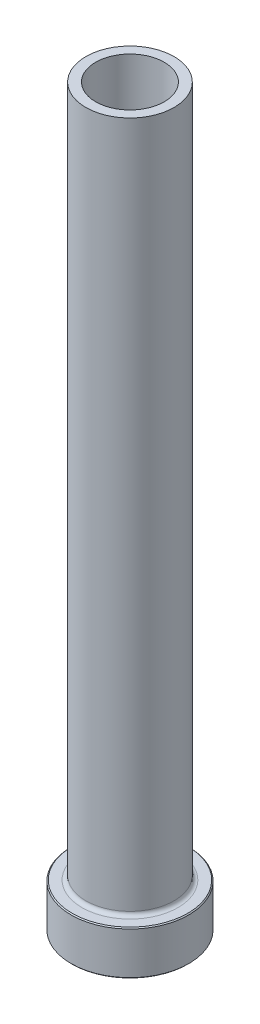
ISO-10303-21;
HEADER;
FILE_DESCRIPTION(('STEP AP214'),'2;1');
FILE_NAME('part.step','',(''),(''),'','','');
FILE_SCHEMA(('AUTOMOTIVE_DESIGN { 1 0 10303 214 1 1 1 1 }'));
ENDSEC;
DATA;
#1=APPLICATION_CONTEXT('core data for automotive mechanical design processes');
#2=APPLICATION_PROTOCOL_DEFINITION('international standard','automotive_design',2000,#1);
#3=PRODUCT_CONTEXT('',#1,'mechanical');
#4=PRODUCT('Part','Part','',(#3));
#5=PRODUCT_RELATED_PRODUCT_CATEGORY('part','',(#4));
#6=PRODUCT_DEFINITION_FORMATION('','',#4);
#7=PRODUCT_DEFINITION_CONTEXT('part definition',#1,'design');
#8=PRODUCT_DEFINITION('design','',#6,#7);
#9=PRODUCT_DEFINITION_SHAPE('','',#8);
#10=(LENGTH_UNIT() NAMED_UNIT(*) SI_UNIT(.MILLI.,.METRE.));
#11=(NAMED_UNIT(*) PLANE_ANGLE_UNIT() SI_UNIT($,.RADIAN.));
#12=(NAMED_UNIT(*) SI_UNIT($,.STERADIAN.) SOLID_ANGLE_UNIT());
#13=UNCERTAINTY_MEASURE_WITH_UNIT(LENGTH_MEASURE(1.E-05),#10,'distance_accuracy_value','');
#14=(GEOMETRIC_REPRESENTATION_CONTEXT(3) GLOBAL_UNCERTAINTY_ASSIGNED_CONTEXT((#13)) GLOBAL_UNIT_ASSIGNED_CONTEXT((#10,
#11,#12)) REPRESENTATION_CONTEXT('',''));
#15=CARTESIAN_POINT('',(0.,0.,0.));
#16=DIRECTION('',(0.,0.,1.));
#17=DIRECTION('',(1.,0.,0.));
#18=AXIS2_PLACEMENT_3D('',#15,#16,#17);
#19=CARTESIAN_POINT('',(0.,92.1876809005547,0.));
#20=DIRECTION('',(0.,1.,0.));
#21=DIRECTION('',(0.,0.,1.));
#22=AXIS2_PLACEMENT_3D('',#19,#20,#21);
#23=CYLINDRICAL_SURFACE('',#22,7.);
#24=CARTESIAN_POINT('',(0.,150.,0.));
#25=DIRECTION('',(0.,1.,0.));
#26=DIRECTION('',(0.,0.,1.));
#27=AXIS2_PLACEMENT_3D('',#24,#25,#26);
#28=CIRCLE('',#27,7.);
#29=CARTESIAN_POINT('',(0.,150.,7.));
#30=VERTEX_POINT('',#29);
#31=EDGE_CURVE('E62',#30,#30,#28,.T.);
#32=ORIENTED_EDGE('',*,*,#31,.T.);
#33=EDGE_LOOP('',(#32));
#34=FACE_BOUND('',#33,.T.);
#35=CARTESIAN_POINT('',(0.,95.,0.));
#36=DIRECTION('',(0.,1.,0.));
#37=DIRECTION('',(0.,0.,1.));
#38=AXIS2_PLACEMENT_3D('',#35,#36,#37);
#39=CIRCLE('',#38,7.);
#40=CARTESIAN_POINT('',(0.,95.,7.));
#41=VERTEX_POINT('',#40);
#42=EDGE_CURVE('E71',#41,#41,#39,.T.);
#43=ORIENTED_EDGE('',*,*,#42,.F.);
#44=EDGE_LOOP('',(#43));
#45=FACE_BOUND('',#44,.T.);
#46=ADVANCED_FACE('F30',(#34,#45),#23,.F.);
#47=CARTESIAN_POINT('',(-7.,150.,0.));
#48=DIRECTION('',(0.,1.,0.));
#49=DIRECTION('',(0.,0.,1.));
#50=AXIS2_PLACEMENT_3D('',#47,#48,#49);
#51=PLANE('',#50);
#52=CARTESIAN_POINT('',(0.,150.,0.));
#53=DIRECTION('',(0.,1.,0.));
#54=DIRECTION('',(0.,0.,1.));
#55=AXIS2_PLACEMENT_3D('',#52,#53,#54);
#56=CIRCLE('',#55,9.00000000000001);
#57=CARTESIAN_POINT('',(0.,150.,9.00000000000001));
#58=VERTEX_POINT('',#57);
#59=EDGE_CURVE('E65',#58,#58,#56,.T.);
#60=ORIENTED_EDGE('',*,*,#59,.T.);
#61=EDGE_LOOP('',(#60));
#62=FACE_BOUND('',#61,.T.);
#63=ORIENTED_EDGE('',*,*,#31,.F.);
#64=EDGE_LOOP('',(#63));
#65=FACE_BOUND('',#64,.T.);
#66=ADVANCED_FACE('F79',(#62,#65),#51,.T.);
#67=CARTESIAN_POINT('',(0.,92.1876809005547,0.));
#68=DIRECTION('',(0.,1.,0.));
#69=DIRECTION('',(0.,0.,1.));
#70=AXIS2_PLACEMENT_3D('',#67,#68,#69);
#71=CYLINDRICAL_SURFACE('',#70,9.);
#72=CARTESIAN_POINT('',(0.,9.8,0.));
#73=DIRECTION('',(0.,1.,0.));
#74=DIRECTION('',(0.,0.,1.));
#75=AXIS2_PLACEMENT_3D('',#72,#73,#74);
#76=CIRCLE('',#75,9.);
#77=CARTESIAN_POINT('',(0.,9.8,9.));
#78=VERTEX_POINT('',#77);
#79=EDGE_CURVE('E59',#78,#78,#76,.T.);
#80=ORIENTED_EDGE('',*,*,#79,.T.);
#81=EDGE_LOOP('',(#80));
#82=FACE_BOUND('',#81,.T.);
#83=ORIENTED_EDGE('',*,*,#59,.F.);
#84=EDGE_LOOP('',(#83));
#85=FACE_BOUND('',#84,.T.);
#86=ADVANCED_FACE('F85',(#82,#85),#71,.T.);
#87=CARTESIAN_POINT('',(-8.99999999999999,9.,0.));
#88=DIRECTION('',(0.,1.,0.));
#89=DIRECTION('',(0.,0.,1.));
#90=AXIS2_PLACEMENT_3D('',#87,#88,#89);
#91=PLANE('',#90);
#92=CARTESIAN_POINT('',(0.,9.,0.));
#93=DIRECTION('',(0.,1.,0.));
#94=DIRECTION('',(0.,0.,1.));
#95=AXIS2_PLACEMENT_3D('',#92,#93,#94);
#96=CIRCLE('',#95,11.8);
#97=CARTESIAN_POINT('',(0.,9.,11.8));
#98=VERTEX_POINT('',#97);
#99=EDGE_CURVE('E53',#98,#98,#96,.T.);
#100=ORIENTED_EDGE('',*,*,#99,.T.);
#101=EDGE_LOOP('',(#100));
#102=FACE_BOUND('',#101,.T.);
#103=CARTESIAN_POINT('',(0.,9.,0.));
#104=DIRECTION('',(0.,1.,0.));
#105=DIRECTION('',(0.,0.,1.));
#106=AXIS2_PLACEMENT_3D('',#103,#104,#105);
#107=CIRCLE('',#106,9.8);
#108=CARTESIAN_POINT('',(0.,9.,9.8));
#109=VERTEX_POINT('',#108);
#110=EDGE_CURVE('E56',#109,#109,#107,.F.);
#111=ORIENTED_EDGE('',*,*,#110,.T.);
#112=EDGE_LOOP('',(#111));
#113=FACE_BOUND('',#112,.T.);
#114=ADVANCED_FACE('F111',(#102,#113),#91,.T.);
#115=CARTESIAN_POINT('',(0.,92.1876809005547,0.));
#116=DIRECTION('',(0.,1.,0.));
#117=DIRECTION('',(0.,0.,1.));
#118=AXIS2_PLACEMENT_3D('',#115,#116,#117);
#119=CYLINDRICAL_SURFACE('',#118,12.);
#120=CARTESIAN_POINT('',(0.,8.8,0.));
#121=DIRECTION('',(0.,1.,0.));
#122=DIRECTION('',(0.,0.,1.));
#123=AXIS2_PLACEMENT_3D('',#120,#121,#122);
#124=CIRCLE('',#123,12.);
#125=CARTESIAN_POINT('',(0.,8.8,12.));
#126=VERTEX_POINT('',#125);
#127=EDGE_CURVE('E45',#126,#126,#124,.F.);
#128=ORIENTED_EDGE('',*,*,#127,.T.);
#129=EDGE_LOOP('',(#128));
#130=FACE_BOUND('',#129,.T.);
#131=CARTESIAN_POINT('',(0.,0.199999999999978,0.));
#132=DIRECTION('',(0.,-1.,0.));
#133=DIRECTION('',(0.,0.,-1.));
#134=AXIS2_PLACEMENT_3D('',#131,#132,#133);
#135=CIRCLE('',#134,12.);
#136=CARTESIAN_POINT('',(0.,0.199999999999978,12.));
#137=VERTEX_POINT('',#136);
#138=EDGE_CURVE('E50',#137,#137,#135,.F.);
#139=ORIENTED_EDGE('',*,*,#138,.T.);
#140=EDGE_LOOP('',(#139));
#141=FACE_BOUND('',#140,.T.);
#142=ADVANCED_FACE('F108',(#130,#141),#119,.T.);
#143=CARTESIAN_POINT('',(-12.,0.,0.));
#144=DIRECTION('',(0.,-1.,0.));
#145=DIRECTION('',(0.,0.,-1.));
#146=AXIS2_PLACEMENT_3D('',#143,#144,#145);
#147=PLANE('',#146);
#148=CARTESIAN_POINT('',(0.,0.,0.));
#149=DIRECTION('',(0.,-1.,0.));
#150=DIRECTION('',(0.,0.,-1.));
#151=AXIS2_PLACEMENT_3D('',#148,#149,#150);
#152=CIRCLE('',#151,7.74999999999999);
#153=CARTESIAN_POINT('',(0.,0.,-7.74999999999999));
#154=VERTEX_POINT('',#153);
#155=EDGE_CURVE('E37',#154,#154,#152,.F.);
#156=ORIENTED_EDGE('',*,*,#155,.T.);
#157=EDGE_LOOP('',(#156));
#158=FACE_BOUND('',#157,.T.);
#159=CARTESIAN_POINT('',(0.,0.,0.));
#160=DIRECTION('',(0.,-1.,0.));
#161=DIRECTION('',(0.,0.,-1.));
#162=AXIS2_PLACEMENT_3D('',#159,#160,#161);
#163=CIRCLE('',#162,11.8);
#164=CARTESIAN_POINT('',(0.,0.,11.8));
#165=VERTEX_POINT('',#164);
#166=EDGE_CURVE('E41',#165,#165,#163,.T.);
#167=ORIENTED_EDGE('',*,*,#166,.T.);
#168=EDGE_LOOP('',(#167));
#169=FACE_BOUND('',#168,.T.);
#170=ADVANCED_FACE('F110',(#158,#169),#147,.T.);
#171=CARTESIAN_POINT('',(0.,92.1876809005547,0.));
#172=DIRECTION('',(0.,1.,0.));
#173=DIRECTION('',(0.,0.,1.));
#174=AXIS2_PLACEMENT_3D('',#171,#172,#173);
#175=CYLINDRICAL_SURFACE('',#174,7.25);
#176=CARTESIAN_POINT('',(0.,0.5,0.));
#177=DIRECTION('',(0.,-1.,0.));
#178=DIRECTION('',(0.,0.,-1.));
#179=AXIS2_PLACEMENT_3D('',#176,#177,#178);
#180=CIRCLE('',#179,7.25);
#181=CARTESIAN_POINT('',(0.,0.5,-7.25));
#182=VERTEX_POINT('',#181);
#183=EDGE_CURVE('E10',#182,#182,#180,.T.);
#184=ORIENTED_EDGE('',*,*,#183,.T.);
#185=EDGE_LOOP('',(#184));
#186=FACE_BOUND('',#185,.T.);
#187=CARTESIAN_POINT('',(0.,83.,0.));
#188=DIRECTION('',(0.,1.,0.));
#189=DIRECTION('',(0.,0.,1.));
#190=AXIS2_PLACEMENT_3D('',#187,#188,#189);
#191=CIRCLE('',#190,7.25);
#192=CARTESIAN_POINT('',(0.,83.,7.25));
#193=VERTEX_POINT('',#192);
#194=EDGE_CURVE('E68',#193,#193,#191,.T.);
#195=ORIENTED_EDGE('',*,*,#194,.T.);
#196=EDGE_LOOP('',(#195));
#197=FACE_BOUND('',#196,.T.);
#198=ADVANCED_FACE('F118',(#186,#197),#175,.F.);
#199=CARTESIAN_POINT('',(0.,83.,0.));
#200=DIRECTION('',(0.,-1.,0.));
#201=DIRECTION('',(0.,0.,-1.));
#202=AXIS2_PLACEMENT_3D('',#199,#200,#201);
#203=CONICAL_SURFACE('',#202,7.25,0.0208303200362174);
#204=ORIENTED_EDGE('',*,*,#42,.T.);
#205=EDGE_LOOP('',(#204));
#206=FACE_BOUND('',#205,.T.);
#207=ORIENTED_EDGE('',*,*,#194,.F.);
#208=EDGE_LOOP('',(#207));
#209=FACE_BOUND('',#208,.T.);
#210=ADVANCED_FACE('F75',(#206,#209),#203,.F.);
#211=CARTESIAN_POINT('',(0.,9.8,0.));
#212=DIRECTION('',(0.,1.,0.));
#213=DIRECTION('',(0.,0.,1.));
#214=AXIS2_PLACEMENT_3D('',#211,#212,#213);
#215=TOROIDAL_SURFACE('',#214,9.8,0.8);
#216=ORIENTED_EDGE('',*,*,#110,.F.);
#217=EDGE_LOOP('',(#216));
#218=FACE_BOUND('',#217,.T.);
#219=ORIENTED_EDGE('',*,*,#79,.F.);
#220=EDGE_LOOP('',(#219));
#221=FACE_BOUND('',#220,.T.);
#222=ADVANCED_FACE('F90',(#218,#221),#215,.F.);
#223=CARTESIAN_POINT('',(0.,9.00000000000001,0.));
#224=DIRECTION('',(0.,-1.,0.));
#225=DIRECTION('',(0.,0.,-1.));
#226=AXIS2_PLACEMENT_3D('',#223,#224,#225);
#227=CONICAL_SURFACE('',#226,11.8,0.785398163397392);
#228=ORIENTED_EDGE('',*,*,#127,.F.);
#229=EDGE_LOOP('',(#228));
#230=FACE_BOUND('',#229,.T.);
#231=ORIENTED_EDGE('',*,*,#99,.F.);
#232=EDGE_LOOP('',(#231));
#233=FACE_BOUND('',#232,.T.);
#234=ADVANCED_FACE('F93',(#230,#233),#227,.T.);
#235=CARTESIAN_POINT('',(0.,0.199999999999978,0.));
#236=DIRECTION('',(0.,1.,0.));
#237=DIRECTION('',(0.,0.,1.));
#238=AXIS2_PLACEMENT_3D('',#235,#236,#237);
#239=CONICAL_SURFACE('',#238,12.,0.785398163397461);
#240=CARTESIAN_POINT('',(0.,0.,11.8));
#241=CARTESIAN_POINT('',(0.,0.00208333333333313,11.8020833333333));
#242=CARTESIAN_POINT('',(0.,0.00416666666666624,11.8041666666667));
#243=CARTESIAN_POINT('',(0.,0.00833333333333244,11.8083333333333));
#244=CARTESIAN_POINT('',(0.,0.0104166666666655,11.8104166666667));
#245=CARTESIAN_POINT('',(0.,0.0145833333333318,11.8145833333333));
#246=CARTESIAN_POINT('',(0.,0.0166666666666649,11.8166666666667));
#247=CARTESIAN_POINT('',(0.,0.0208333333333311,11.8208333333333));
#248=CARTESIAN_POINT('',(0.,0.0229166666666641,11.8229166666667));
#249=CARTESIAN_POINT('',(0.,0.0270833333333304,11.8270833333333));
#250=CARTESIAN_POINT('',(0.,0.0291666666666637,11.8291666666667));
#251=CARTESIAN_POINT('',(0.,0.0333333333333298,11.8333333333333));
#252=CARTESIAN_POINT('',(0.,0.0354166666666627,11.8354166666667));
#253=CARTESIAN_POINT('',(0.,0.0395833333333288,11.8395833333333));
#254=CARTESIAN_POINT('',(0.,0.0416666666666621,11.8416666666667));
#255=CARTESIAN_POINT('',(0.,0.0458333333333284,11.8458333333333));
#256=CARTESIAN_POINT('',(0.,0.0479166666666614,11.8479166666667));
#257=CARTESIAN_POINT('',(0.,0.0520833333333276,11.8520833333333));
#258=CARTESIAN_POINT('',(0.,0.0541666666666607,11.8541666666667));
#259=CARTESIAN_POINT('',(0.,0.0583333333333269,11.8583333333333));
#260=CARTESIAN_POINT('',(0.,0.06041666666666,11.8604166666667));
#261=CARTESIAN_POINT('',(0.,0.0645833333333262,11.8645833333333));
#262=CARTESIAN_POINT('',(0.,0.0666666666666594,11.8666666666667));
#263=CARTESIAN_POINT('',(0.,0.0708333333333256,11.8708333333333));
#264=CARTESIAN_POINT('',(0.,0.0729166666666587,11.8729166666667));
#265=CARTESIAN_POINT('',(0.,0.0770833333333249,11.8770833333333));
#266=CARTESIAN_POINT('',(0.,0.079166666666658,11.8791666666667));
#267=CARTESIAN_POINT('',(0.,0.0833333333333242,11.8833333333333));
#268=CARTESIAN_POINT('',(0.,0.0854166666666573,11.8854166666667));
#269=CARTESIAN_POINT('',(0.,0.0895833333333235,11.8895833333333));
#270=CARTESIAN_POINT('',(0.,0.0916666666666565,11.8916666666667));
#271=CARTESIAN_POINT('',(0.,0.0958333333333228,11.8958333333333));
#272=CARTESIAN_POINT('',(0.,0.0979166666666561,11.8979166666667));
#273=CARTESIAN_POINT('',(0.,0.102083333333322,11.9020833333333));
#274=CARTESIAN_POINT('',(0.,0.104166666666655,11.9041666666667));
#275=CARTESIAN_POINT('',(0.,0.108333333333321,11.9083333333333));
#276=CARTESIAN_POINT('',(0.,0.110416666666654,11.9104166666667));
#277=CARTESIAN_POINT('',(0.,0.114583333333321,11.9145833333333));
#278=CARTESIAN_POINT('',(0.,0.116666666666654,11.9166666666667));
#279=CARTESIAN_POINT('',(0.,0.12083333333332,11.9208333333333));
#280=CARTESIAN_POINT('',(0.,0.122916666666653,11.9229166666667));
#281=CARTESIAN_POINT('',(0.,0.127083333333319,11.9270833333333));
#282=CARTESIAN_POINT('',(0.,0.129166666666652,11.9291666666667));
#283=CARTESIAN_POINT('',(0.,0.133333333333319,11.9333333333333));
#284=CARTESIAN_POINT('',(0.,0.135416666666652,11.9354166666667));
#285=CARTESIAN_POINT('',(0.,0.139583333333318,11.9395833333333));
#286=CARTESIAN_POINT('',(0.,0.141666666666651,11.9416666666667));
#287=CARTESIAN_POINT('',(0.,0.145833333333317,11.9458333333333));
#288=CARTESIAN_POINT('',(0.,0.14791666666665,11.9479166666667));
#289=CARTESIAN_POINT('',(0.,0.152083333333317,11.9520833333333));
#290=CARTESIAN_POINT('',(0.,0.15416666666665,11.9541666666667));
#291=CARTESIAN_POINT('',(0.,0.158333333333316,11.9583333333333));
#292=CARTESIAN_POINT('',(0.,0.160416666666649,11.9604166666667));
#293=CARTESIAN_POINT('',(0.,0.164583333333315,11.9645833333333));
#294=CARTESIAN_POINT('',(0.,0.166666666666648,11.9666666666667));
#295=CARTESIAN_POINT('',(0.,0.170833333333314,11.9708333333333));
#296=CARTESIAN_POINT('',(0.,0.172916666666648,11.9729166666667));
#297=CARTESIAN_POINT('',(0.,0.177083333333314,11.9770833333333));
#298=CARTESIAN_POINT('',(0.,0.179166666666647,11.9791666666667));
#299=CARTESIAN_POINT('',(0.,0.183333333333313,11.9833333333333));
#300=CARTESIAN_POINT('',(0.,0.185416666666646,11.9854166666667));
#301=CARTESIAN_POINT('',(0.,0.189583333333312,11.9895833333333));
#302=CARTESIAN_POINT('',(0.,0.191666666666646,11.9916666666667));
#303=CARTESIAN_POINT('',(0.,0.195833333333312,11.9958333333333));
#304=CARTESIAN_POINT('',(0.,0.197916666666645,11.9979166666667));
#305=CARTESIAN_POINT('',(0.,0.199999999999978,12.));
#306=B_SPLINE_CURVE_WITH_KNOTS('',3,(#240,#241,#242,#243,#244,#245,#246,#247,#248,#249,#250,
#251,#252,#253,#254,#255,#256,#257,#258,#259,#260,#261,#262,#263,#264,#265,#266,#267,#268,#269,
#270,#271,#272,#273,#274,#275,#276,#277,#278,#279,#280,#281,#282,#283,#284,#285,#286,#287,#288,
#289,#290,#291,#292,#293,#294,#295,#296,#297,#298,#299,#300,#301,#302,#303,#304,#305),
.UNSPECIFIED.,.F.,.F.,(4,2,2,2,2,2,2,2,2,2,2,2,2,2,2,2,2,2,2,2,2,2,2,2,2,2,2,2,2,2,2,2,4),(0.,
0.00883883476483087,0.0176776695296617,0.0265165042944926,0.0353553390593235,0.0441941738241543,
0.0530330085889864,0.0618718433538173,0.0707106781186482,0.079549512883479,0.0883883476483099,
0.0972271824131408,0.106066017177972,0.114904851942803,0.123743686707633,0.132582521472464,
0.141421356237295,0.150260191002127,0.159099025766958,0.167937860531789,0.17677669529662,
0.185615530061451,0.194454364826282,0.203293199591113,0.212132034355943,0.220970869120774,
0.229809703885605,0.238648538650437,0.247487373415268,0.256326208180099,0.26516504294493,
0.274003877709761,0.282842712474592),.UNSPECIFIED.);
#307=EDGE_CURVE('BSEAM96',#165,#137,#306,.T.);
#308=ORIENTED_EDGE('',*,*,#166,.F.);
#309=ORIENTED_EDGE('',*,*,#138,.F.);
#310=ORIENTED_EDGE('',*,*,#307,.T.);
#311=ORIENTED_EDGE('',*,*,#307,.F.);
#312=EDGE_LOOP('',(#308,#310,#309,#311));
#313=FACE_BOUND('',#312,.T.);
#314=ADVANCED_FACE('F96',(#313),#239,.T.);
#315=CARTESIAN_POINT('',(0.,0.,0.));
#316=DIRECTION('',(0.,-1.,0.));
#317=DIRECTION('',(0.,0.,-1.));
#318=AXIS2_PLACEMENT_3D('',#315,#316,#317);
#319=CONICAL_SURFACE('',#318,7.74999999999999,0.785398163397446);
#320=ORIENTED_EDGE('',*,*,#183,.F.);
#321=EDGE_LOOP('',(#320));
#322=FACE_BOUND('',#321,.T.);
#323=ORIENTED_EDGE('',*,*,#155,.F.);
#324=EDGE_LOOP('',(#323));
#325=FACE_BOUND('',#324,.T.);
#326=ADVANCED_FACE('F32',(#322,#325),#319,.F.);
#327=CLOSED_SHELL('',(#46,#66,#86,#114,#142,#170,#198,#210,#222,#234,#314,#326));
#328=MANIFOLD_SOLID_BREP('B2',#327);
#329=ADVANCED_BREP_SHAPE_REPRESENTATION('',(#18,#328),#14);
#330=SHAPE_DEFINITION_REPRESENTATION(#9,#329);
ENDSEC;
END-ISO-10303-21;
